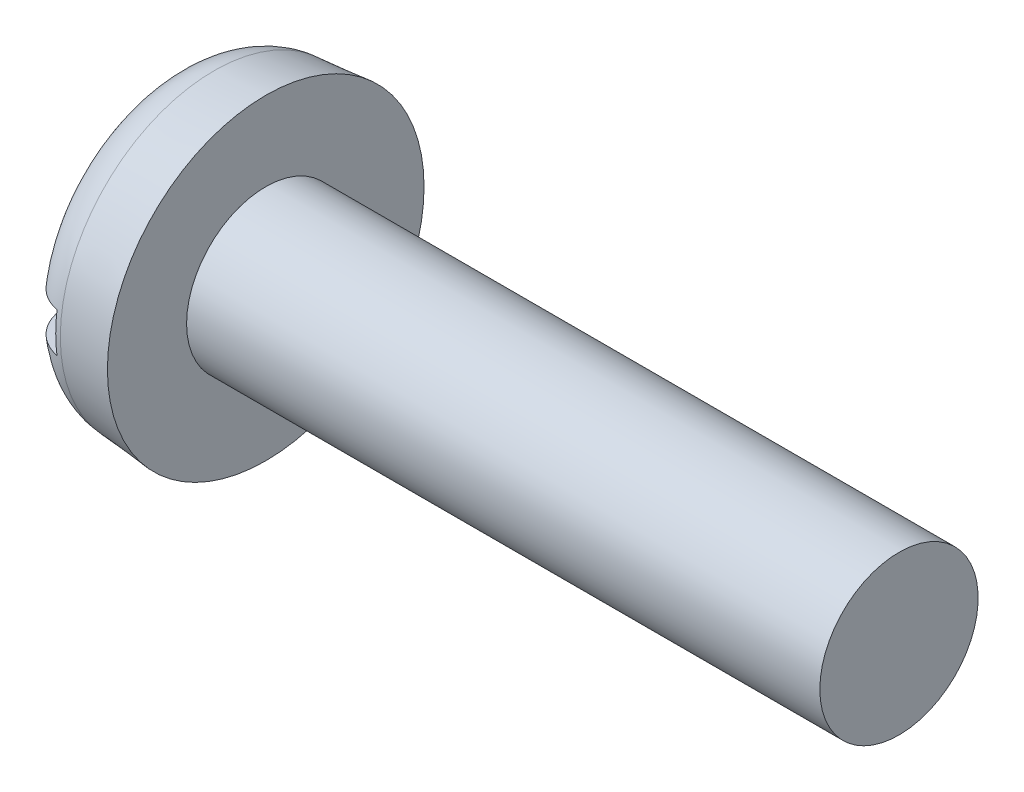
from build123d import *

# Parameters (mm, degrees)
FILLET2_R  = 3
SKETCH2_W  = 20
SKETCH2_H  = 2.5
SLOT_DEPTH = 2.4


with BuildPart() as part:
    # BodySke → Base-Revolve (revolve)
    with BuildSketch(Plane.XY, mode=Mode.PRIVATE) as base_revolve_sk:
        Polygon((6, 5), (6, 10), (0, 9.475068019), (0, 0), (46, 0), (46, 5), align=None)
    revolve(base_revolve_sk.sketch.rotate(Axis((-25.4, 0, 0), (1, 0, 0)), 90), axis=Axis((-25.4, 0, 0), (1, 0, 0)))

    # Fillet2
    fillet2_edges = [part.edges().sort_by_distance(p)[0] for p in [
        (0, 0, -9.475068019),
    ]]
    fillet(fillet2_edges, radius=FILLET2_R)

    # Sketch2 → Slot (cut)
    with BuildSketch(Plane(origin=(0, 0, 0), x_dir=(0, 0, -1), z_dir=(1, 0, 0))):
        Rectangle(SKETCH2_W, SKETCH2_H)
    extrude(amount=SLOT_DEPTH, mode=Mode.SUBTRACT)


solid = part.part
